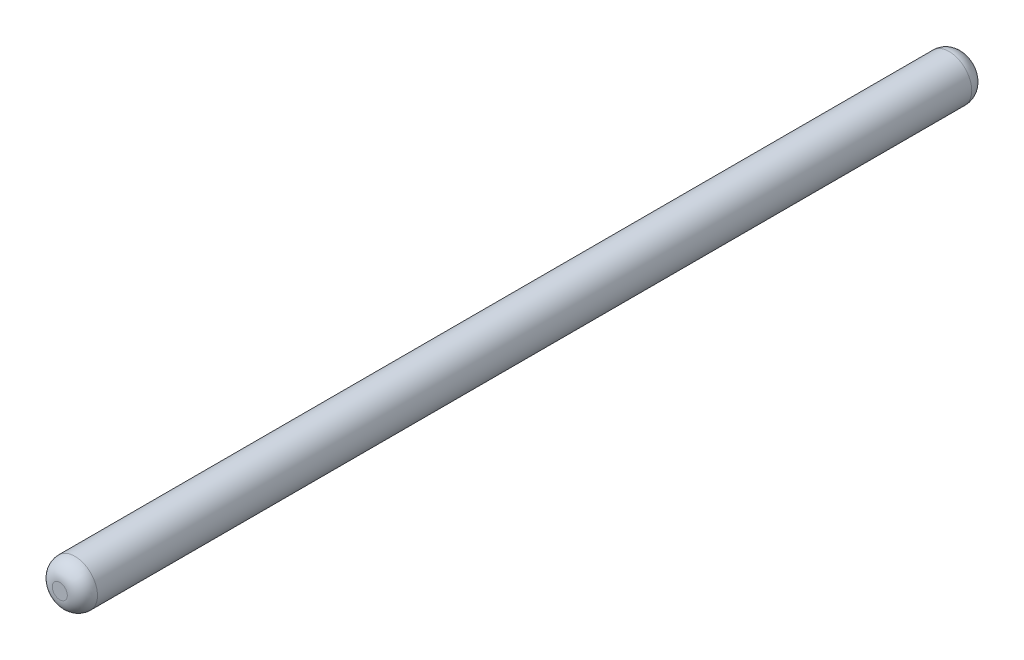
from build123d import *

# Parameters (mm, degrees)
CROQUIS1_R              = 1.5
SALIENTE_EXTRUIR1_DEPTH = 30
REDONDEO1_R             = 1


with BuildPart() as part:
    # Croquis1 → Saliente-Extruir1 (new, symmetric)
    with BuildSketch(Plane.XY):
        Circle(CROQUIS1_R)
    extrude(amount=SALIENTE_EXTRUIR1_DEPTH, both=True)

    # Redondeo1
    redondeo1_edges = [part.edges().sort_by_distance(p)[0] for p in [
        (-1.5, 0, -30),
        (-1.5, 0, 30),
    ]]
    fillet(redondeo1_edges, radius=REDONDEO1_R)


solid = part.part
